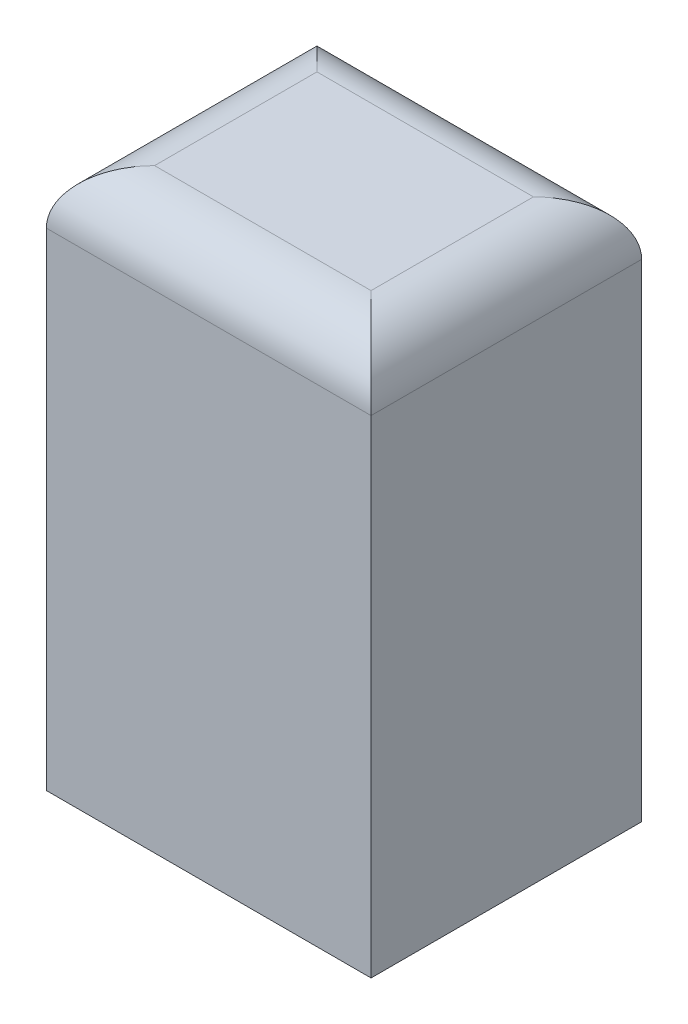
ISO-10303-21;
HEADER;
FILE_DESCRIPTION(('STEP AP214'),'2;1');
FILE_NAME('part.step','',(''),(''),'','','');
FILE_SCHEMA(('AUTOMOTIVE_DESIGN { 1 0 10303 214 1 1 1 1 }'));
ENDSEC;
DATA;
#1=APPLICATION_CONTEXT('core data for automotive mechanical design processes');
#2=APPLICATION_PROTOCOL_DEFINITION('international standard','automotive_design',2000,#1);
#3=PRODUCT_CONTEXT('',#1,'mechanical');
#4=PRODUCT('Part','Part','',(#3));
#5=PRODUCT_RELATED_PRODUCT_CATEGORY('part','',(#4));
#6=PRODUCT_DEFINITION_FORMATION('','',#4);
#7=PRODUCT_DEFINITION_CONTEXT('part definition',#1,'design');
#8=PRODUCT_DEFINITION('design','',#6,#7);
#9=PRODUCT_DEFINITION_SHAPE('','',#8);
#10=(LENGTH_UNIT() NAMED_UNIT(*) SI_UNIT(.MILLI.,.METRE.));
#11=(NAMED_UNIT(*) PLANE_ANGLE_UNIT() SI_UNIT($,.RADIAN.));
#12=(NAMED_UNIT(*) SI_UNIT($,.STERADIAN.) SOLID_ANGLE_UNIT());
#13=UNCERTAINTY_MEASURE_WITH_UNIT(LENGTH_MEASURE(1.E-05),#10,'distance_accuracy_value','');
#14=(GEOMETRIC_REPRESENTATION_CONTEXT(3) GLOBAL_UNCERTAINTY_ASSIGNED_CONTEXT((#13)) GLOBAL_UNIT_ASSIGNED_CONTEXT((#10,
#11,#12)) REPRESENTATION_CONTEXT('',''));
#15=CARTESIAN_POINT('',(0.,0.,0.));
#16=DIRECTION('',(0.,0.,1.));
#17=DIRECTION('',(1.,0.,0.));
#18=AXIS2_PLACEMENT_3D('',#15,#16,#17);
#19=CARTESIAN_POINT('',(1.347852,1.8,0.8));
#20=DIRECTION('',(-1.,0.,0.));
#21=DIRECTION('',(0.,0.,1.));
#22=AXIS2_PLACEMENT_3D('',#19,#20,#21);
#23=CYLINDRICAL_SURFACE('',#22,0.2);
#24=DIRECTION('',(1.,0.,0.));
#25=VECTOR('',#24,1.);
#26=CARTESIAN_POINT('',(0.,1.8,1.));
#27=LINE('',#26,#25);
#28=CARTESIAN_POINT('',(1.2,1.8,1.));
#29=VERTEX_POINT('',#28);
#30=CARTESIAN_POINT('',(0.,1.8,1.));
#31=VERTEX_POINT('',#30);
#32=EDGE_CURVE('E62',#29,#31,#27,.F.);
#33=ORIENTED_EDGE('',*,*,#32,.F.);
#34=CARTESIAN_POINT('',(1.,1.8,0.8));
#35=DIRECTION('',(0.707106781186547,0.,-0.707106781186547));
#36=DIRECTION('',(-0.707106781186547,0.,-0.707106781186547));
#37=AXIS2_PLACEMENT_3D('',#34,#35,#36);
#38=ELLIPSE('',#37,0.282842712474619,0.2);
#39=CARTESIAN_POINT('',(1.,2.,0.8));
#40=VERTEX_POINT('',#39);
#41=EDGE_CURVE('E117',#40,#29,#38,.T.);
#42=ORIENTED_EDGE('',*,*,#41,.F.);
#43=DIRECTION('',(1.,0.,0.));
#44=VECTOR('',#43,1.);
#45=CARTESIAN_POINT('',(1.2,2.,0.8));
#46=LINE('',#45,#44);
#47=CARTESIAN_POINT('',(0.2,2.,0.8));
#48=VERTEX_POINT('',#47);
#49=EDGE_CURVE('E121',#48,#40,#46,.T.);
#50=ORIENTED_EDGE('',*,*,#49,.F.);
#51=CARTESIAN_POINT('',(0.2,1.8,0.8));
#52=DIRECTION('',(-0.707106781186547,0.,-0.707106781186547));
#53=DIRECTION('',(0.707106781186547,0.,-0.707106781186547));
#54=AXIS2_PLACEMENT_3D('',#51,#52,#53);
#55=ELLIPSE('',#54,0.282842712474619,0.2);
#56=EDGE_CURVE('E20',#31,#48,#55,.T.);
#57=ORIENTED_EDGE('',*,*,#56,.F.);
#58=EDGE_LOOP('',(#33,#42,#50,#57));
#59=FACE_BOUND('',#58,.T.);
#60=ADVANCED_FACE('F17',(#59),#23,.T.);
#61=CARTESIAN_POINT('',(0.,0.,1.));
#62=DIRECTION('',(0.,0.,1.));
#63=DIRECTION('',(1.,0.,0.));
#64=AXIS2_PLACEMENT_3D('',#61,#62,#63);
#65=PLANE('',#64);
#66=DIRECTION('',(1.,0.,0.));
#67=VECTOR('',#66,1.);
#68=CARTESIAN_POINT('',(0.,0.,1.));
#69=LINE('',#68,#67);
#70=CARTESIAN_POINT('',(1.2,0.,1.));
#71=VERTEX_POINT('',#70);
#72=CARTESIAN_POINT('',(0.,0.,1.));
#73=VERTEX_POINT('',#72);
#74=EDGE_CURVE('E69',#71,#73,#69,.F.);
#75=ORIENTED_EDGE('',*,*,#74,.F.);
#76=DIRECTION('',(0.,1.,0.));
#77=VECTOR('',#76,1.);
#78=CARTESIAN_POINT('',(1.2,0.,1.));
#79=LINE('',#78,#77);
#80=EDGE_CURVE('E105',#29,#71,#79,.F.);
#81=ORIENTED_EDGE('',*,*,#80,.F.);
#82=ORIENTED_EDGE('',*,*,#32,.T.);
#83=DIRECTION('',(0.,1.,0.));
#84=VECTOR('',#83,1.);
#85=CARTESIAN_POINT('',(0.,2.,1.));
#86=LINE('',#85,#84);
#87=EDGE_CURVE('E116',#73,#31,#86,.T.);
#88=ORIENTED_EDGE('',*,*,#87,.F.);
#89=EDGE_LOOP('',(#75,#81,#82,#88));
#90=FACE_BOUND('',#89,.T.);
#91=ADVANCED_FACE('F145',(#90),#65,.T.);
#92=CARTESIAN_POINT('',(0.2,1.8,1.15648));
#93=DIRECTION('',(0.,0.,-1.));
#94=DIRECTION('',(-1.,0.,0.));
#95=AXIS2_PLACEMENT_3D('',#92,#93,#94);
#96=CYLINDRICAL_SURFACE('',#95,0.2);
#97=DIRECTION('',(0.,0.,1.));
#98=VECTOR('',#97,1.);
#99=CARTESIAN_POINT('',(0.,1.8,0.));
#100=LINE('',#99,#98);
#101=CARTESIAN_POINT('',(0.,1.8,0.));
#102=VERTEX_POINT('',#101);
#103=EDGE_CURVE('E95',#31,#102,#100,.F.);
#104=ORIENTED_EDGE('',*,*,#103,.F.);
#105=ORIENTED_EDGE('',*,*,#56,.T.);
#106=DIRECTION('',(0.,0.,1.));
#107=VECTOR('',#106,1.);
#108=CARTESIAN_POINT('',(0.2,2.,0.));
#109=LINE('',#108,#107);
#110=CARTESIAN_POINT('',(0.2,2.,0.2));
#111=VERTEX_POINT('',#110);
#112=EDGE_CURVE('E122',#111,#48,#109,.T.);
#113=ORIENTED_EDGE('',*,*,#112,.F.);
#114=CARTESIAN_POINT('',(0.2,1.8,0.2));
#115=DIRECTION('',(0.707106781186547,0.,-0.707106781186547));
#116=DIRECTION('',(0.707106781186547,0.,0.707106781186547));
#117=AXIS2_PLACEMENT_3D('',#114,#115,#116);
#118=ELLIPSE('',#117,0.282842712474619,0.2);
#119=EDGE_CURVE('E108',#102,#111,#118,.T.);
#120=ORIENTED_EDGE('',*,*,#119,.F.);
#121=EDGE_LOOP('',(#104,#105,#113,#120));
#122=FACE_BOUND('',#121,.T.);
#123=ADVANCED_FACE('F147',(#122),#96,.T.);
#124=CARTESIAN_POINT('',(1.2,2.,0.));
#125=DIRECTION('',(0.,1.,0.));
#126=DIRECTION('',(0.,0.,1.));
#127=AXIS2_PLACEMENT_3D('',#124,#125,#126);
#128=PLANE('',#127);
#129=ORIENTED_EDGE('',*,*,#49,.T.);
#130=DIRECTION('',(0.,0.,-1.));
#131=VECTOR('',#130,1.);
#132=CARTESIAN_POINT('',(1.,2.,1.15648));
#133=LINE('',#132,#131);
#134=CARTESIAN_POINT('',(1.,2.,0.2));
#135=VERTEX_POINT('',#134);
#136=EDGE_CURVE('E118',#135,#40,#133,.F.);
#137=ORIENTED_EDGE('',*,*,#136,.F.);
#138=DIRECTION('',(1.,0.,0.));
#139=VECTOR('',#138,1.);
#140=CARTESIAN_POINT('',(-0.161184,2.,0.2));
#141=LINE('',#140,#139);
#142=EDGE_CURVE('E97',#111,#135,#141,.T.);
#143=ORIENTED_EDGE('',*,*,#142,.F.);
#144=ORIENTED_EDGE('',*,*,#112,.T.);
#145=EDGE_LOOP('',(#129,#137,#143,#144));
#146=FACE_BOUND('',#145,.T.);
#147=ADVANCED_FACE('F167',(#146),#128,.T.);
#148=CARTESIAN_POINT('',(1.,1.8,1.15648));
#149=DIRECTION('',(0.,0.,-1.));
#150=DIRECTION('',(-1.,0.,0.));
#151=AXIS2_PLACEMENT_3D('',#148,#149,#150);
#152=CYLINDRICAL_SURFACE('',#151,0.2);
#153=ORIENTED_EDGE('',*,*,#136,.T.);
#154=ORIENTED_EDGE('',*,*,#41,.T.);
#155=DIRECTION('',(0.,0.,-1.));
#156=VECTOR('',#155,1.);
#157=CARTESIAN_POINT('',(1.2,1.8,0.));
#158=LINE('',#157,#156);
#159=CARTESIAN_POINT('',(1.2,1.8,0.));
#160=VERTEX_POINT('',#159);
#161=EDGE_CURVE('E82',#160,#29,#158,.F.);
#162=ORIENTED_EDGE('',*,*,#161,.F.);
#163=CARTESIAN_POINT('',(1.,1.8,0.2));
#164=DIRECTION('',(0.707106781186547,0.,0.707106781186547));
#165=DIRECTION('',(0.707106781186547,0.,-0.707106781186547));
#166=AXIS2_PLACEMENT_3D('',#163,#164,#165);
#167=ELLIPSE('',#166,0.282842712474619,0.2);
#168=EDGE_CURVE('E34',#135,#160,#167,.F.);
#169=ORIENTED_EDGE('',*,*,#168,.F.);
#170=EDGE_LOOP('',(#153,#154,#162,#169));
#171=FACE_BOUND('',#170,.T.);
#172=ADVANCED_FACE('F138',(#171),#152,.T.);
#173=CARTESIAN_POINT('',(0.,2.,0.));
#174=DIRECTION('',(-1.,0.,0.));
#175=DIRECTION('',(0.,0.,1.));
#176=AXIS2_PLACEMENT_3D('',#173,#174,#175);
#177=PLANE('',#176);
#178=DIRECTION('',(0.,0.,-1.));
#179=VECTOR('',#178,1.);
#180=CARTESIAN_POINT('',(0.,0.,0.));
#181=LINE('',#180,#179);
#182=CARTESIAN_POINT('',(0.,0.,0.));
#183=VERTEX_POINT('',#182);
#184=EDGE_CURVE('E75',#73,#183,#181,.T.);
#185=ORIENTED_EDGE('',*,*,#184,.F.);
#186=ORIENTED_EDGE('',*,*,#87,.T.);
#187=ORIENTED_EDGE('',*,*,#103,.T.);
#188=DIRECTION('',(0.,1.,0.));
#189=VECTOR('',#188,1.);
#190=CARTESIAN_POINT('',(0.,0.,0.));
#191=LINE('',#190,#189);
#192=EDGE_CURVE('E89',#102,#183,#191,.F.);
#193=ORIENTED_EDGE('',*,*,#192,.T.);
#194=EDGE_LOOP('',(#185,#186,#187,#193));
#195=FACE_BOUND('',#194,.T.);
#196=ADVANCED_FACE('F93',(#195),#177,.T.);
#197=CARTESIAN_POINT('',(0.,0.,0.));
#198=DIRECTION('',(0.,-1.,0.));
#199=DIRECTION('',(0.,0.,-1.));
#200=AXIS2_PLACEMENT_3D('',#197,#198,#199);
#201=PLANE('',#200);
#202=ORIENTED_EDGE('',*,*,#74,.T.);
#203=ORIENTED_EDGE('',*,*,#184,.T.);
#204=DIRECTION('',(1.,0.,0.));
#205=VECTOR('',#204,1.);
#206=CARTESIAN_POINT('',(0.,0.,0.));
#207=LINE('',#206,#205);
#208=CARTESIAN_POINT('',(1.2,0.,0.));
#209=VERTEX_POINT('',#208);
#210=EDGE_CURVE('E78',#183,#209,#207,.T.);
#211=ORIENTED_EDGE('',*,*,#210,.T.);
#212=DIRECTION('',(0.,0.,-1.));
#213=VECTOR('',#212,1.);
#214=CARTESIAN_POINT('',(1.2,0.,0.));
#215=LINE('',#214,#213);
#216=EDGE_CURVE('E106',#71,#209,#215,.T.);
#217=ORIENTED_EDGE('',*,*,#216,.F.);
#218=EDGE_LOOP('',(#202,#203,#211,#217));
#219=FACE_BOUND('',#218,.T.);
#220=ADVANCED_FACE('F77',(#219),#201,.T.);
#221=CARTESIAN_POINT('',(1.2,0.,0.));
#222=DIRECTION('',(1.,0.,0.));
#223=DIRECTION('',(0.,0.,-1.));
#224=AXIS2_PLACEMENT_3D('',#221,#222,#223);
#225=PLANE('',#224);
#226=ORIENTED_EDGE('',*,*,#216,.T.);
#227=DIRECTION('',(0.,1.,0.));
#228=VECTOR('',#227,1.);
#229=CARTESIAN_POINT('',(1.2,0.,0.));
#230=LINE('',#229,#228);
#231=EDGE_CURVE('E26',#209,#160,#230,.T.);
#232=ORIENTED_EDGE('',*,*,#231,.T.);
#233=ORIENTED_EDGE('',*,*,#161,.T.);
#234=ORIENTED_EDGE('',*,*,#80,.T.);
#235=EDGE_LOOP('',(#226,#232,#233,#234));
#236=FACE_BOUND('',#235,.T.);
#237=ADVANCED_FACE('F143',(#236),#225,.T.);
#238=CARTESIAN_POINT('',(-0.161184,1.8,0.2));
#239=DIRECTION('',(1.,0.,0.));
#240=DIRECTION('',(0.,0.,-1.));
#241=AXIS2_PLACEMENT_3D('',#238,#239,#240);
#242=CYLINDRICAL_SURFACE('',#241,0.2);
#243=ORIENTED_EDGE('',*,*,#142,.T.);
#244=ORIENTED_EDGE('',*,*,#168,.T.);
#245=DIRECTION('',(1.,0.,0.));
#246=VECTOR('',#245,1.);
#247=CARTESIAN_POINT('',(0.,1.8,0.));
#248=LINE('',#247,#246);
#249=EDGE_CURVE('E11',#160,#102,#248,.F.);
#250=ORIENTED_EDGE('',*,*,#249,.T.);
#251=ORIENTED_EDGE('',*,*,#119,.T.);
#252=EDGE_LOOP('',(#243,#244,#250,#251));
#253=FACE_BOUND('',#252,.T.);
#254=ADVANCED_FACE('F150',(#253),#242,.T.);
#255=CARTESIAN_POINT('',(0.,0.,0.));
#256=DIRECTION('',(0.,0.,1.));
#257=DIRECTION('',(1.,0.,0.));
#258=AXIS2_PLACEMENT_3D('',#255,#256,#257);
#259=PLANE('',#258);
#260=ORIENTED_EDGE('',*,*,#231,.F.);
#261=ORIENTED_EDGE('',*,*,#210,.F.);
#262=ORIENTED_EDGE('',*,*,#192,.F.);
#263=ORIENTED_EDGE('',*,*,#249,.F.);
#264=EDGE_LOOP('',(#260,#261,#262,#263));
#265=FACE_BOUND('',#264,.T.);
#266=ADVANCED_FACE('F87',(#265),#259,.F.);
#267=CLOSED_SHELL('',(#60,#91,#123,#147,#172,#196,#220,#237,#254,#266));
#268=MANIFOLD_SOLID_BREP('B1',#267);
#269=ADVANCED_BREP_SHAPE_REPRESENTATION('',(#18,#268),#14);
#270=SHAPE_DEFINITION_REPRESENTATION(#9,#269);
ENDSEC;
END-ISO-10303-21;
